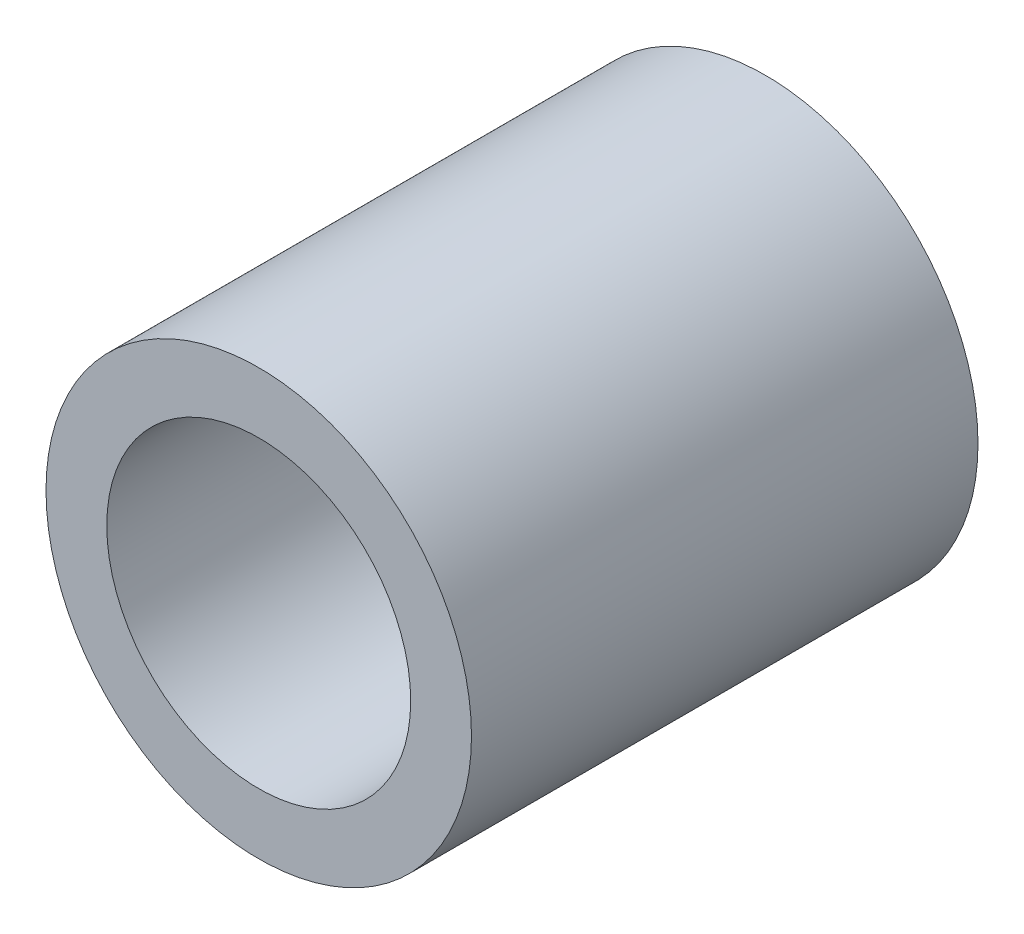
ISO-10303-21;
HEADER;
FILE_DESCRIPTION(('STEP AP214'),'2;1');
FILE_NAME('part.step','',(''),(''),'','','');
FILE_SCHEMA(('AUTOMOTIVE_DESIGN { 1 0 10303 214 1 1 1 1 }'));
ENDSEC;
DATA;
#1=APPLICATION_CONTEXT('core data for automotive mechanical design processes');
#2=APPLICATION_PROTOCOL_DEFINITION('international standard','automotive_design',2000,#1);
#3=PRODUCT_CONTEXT('',#1,'mechanical');
#4=PRODUCT('Part','Part','',(#3));
#5=PRODUCT_RELATED_PRODUCT_CATEGORY('part','',(#4));
#6=PRODUCT_DEFINITION_FORMATION('','',#4);
#7=PRODUCT_DEFINITION_CONTEXT('part definition',#1,'design');
#8=PRODUCT_DEFINITION('design','',#6,#7);
#9=PRODUCT_DEFINITION_SHAPE('','',#8);
#10=(LENGTH_UNIT() NAMED_UNIT(*) SI_UNIT(.MILLI.,.METRE.));
#11=(NAMED_UNIT(*) PLANE_ANGLE_UNIT() SI_UNIT($,.RADIAN.));
#12=(NAMED_UNIT(*) SI_UNIT($,.STERADIAN.) SOLID_ANGLE_UNIT());
#13=UNCERTAINTY_MEASURE_WITH_UNIT(LENGTH_MEASURE(1.E-05),#10,'distance_accuracy_value','');
#14=(GEOMETRIC_REPRESENTATION_CONTEXT(3) GLOBAL_UNCERTAINTY_ASSIGNED_CONTEXT((#13)) GLOBAL_UNIT_ASSIGNED_CONTEXT((#10,
#11,#12)) REPRESENTATION_CONTEXT('',''));
#15=CARTESIAN_POINT('',(0.,0.,0.));
#16=DIRECTION('',(0.,0.,1.));
#17=DIRECTION('',(1.,0.,0.));
#18=AXIS2_PLACEMENT_3D('',#15,#16,#17);
#19=CARTESIAN_POINT('',(0.,0.,25.4));
#20=DIRECTION('',(0.,0.,1.));
#21=DIRECTION('',(1.,0.,0.));
#22=AXIS2_PLACEMENT_3D('',#19,#20,#21);
#23=PLANE('',#22);
#24=CARTESIAN_POINT('',(0.,0.,25.4));
#25=DIRECTION('',(0.,0.,1.));
#26=DIRECTION('',(1.,0.,0.));
#27=AXIS2_PLACEMENT_3D('',#24,#25,#26);
#28=CIRCLE('',#27,10.668);
#29=CARTESIAN_POINT('',(10.668,0.,25.4));
#30=VERTEX_POINT('',#29);
#31=EDGE_CURVE('E10',#30,#30,#28,.T.);
#32=ORIENTED_EDGE('',*,*,#31,.T.);
#33=EDGE_LOOP('',(#32));
#34=FACE_BOUND('',#33,.T.);
#35=CARTESIAN_POINT('',(0.,0.,25.4));
#36=DIRECTION('',(0.,0.,1.));
#37=DIRECTION('',(1.,0.,0.));
#38=AXIS2_PLACEMENT_3D('',#35,#36,#37);
#39=CIRCLE('',#38,7.62);
#40=CARTESIAN_POINT('',(7.62,0.,25.4));
#41=VERTEX_POINT('',#40);
#42=EDGE_CURVE('E39',#41,#41,#39,.T.);
#43=ORIENTED_EDGE('',*,*,#42,.F.);
#44=EDGE_LOOP('',(#43));
#45=FACE_BOUND('',#44,.T.);
#46=ADVANCED_FACE('F28',(#34,#45),#23,.T.);
#47=CARTESIAN_POINT('',(0.,0.,0.));
#48=DIRECTION('',(0.,0.,1.));
#49=DIRECTION('',(1.,0.,0.));
#50=AXIS2_PLACEMENT_3D('',#47,#48,#49);
#51=PLANE('',#50);
#52=CARTESIAN_POINT('',(0.,0.,0.));
#53=DIRECTION('',(0.,0.,1.));
#54=DIRECTION('',(1.,0.,0.));
#55=AXIS2_PLACEMENT_3D('',#52,#53,#54);
#56=CIRCLE('',#55,10.668);
#57=CARTESIAN_POINT('',(10.668,0.,0.));
#58=VERTEX_POINT('',#57);
#59=EDGE_CURVE('E32',#58,#58,#56,.T.);
#60=ORIENTED_EDGE('',*,*,#59,.F.);
#61=EDGE_LOOP('',(#60));
#62=FACE_BOUND('',#61,.T.);
#63=CARTESIAN_POINT('',(0.,0.,0.));
#64=DIRECTION('',(0.,0.,1.));
#65=DIRECTION('',(1.,0.,0.));
#66=AXIS2_PLACEMENT_3D('',#63,#64,#65);
#67=CIRCLE('',#66,7.62);
#68=CARTESIAN_POINT('',(7.62,0.,0.));
#69=VERTEX_POINT('',#68);
#70=EDGE_CURVE('E41',#69,#69,#67,.T.);
#71=ORIENTED_EDGE('',*,*,#70,.T.);
#72=EDGE_LOOP('',(#71));
#73=FACE_BOUND('',#72,.T.);
#74=ADVANCED_FACE('F51',(#62,#73),#51,.F.);
#75=CARTESIAN_POINT('',(0.,0.,25.4));
#76=DIRECTION('',(0.,0.,-1.));
#77=DIRECTION('',(-1.,0.,0.));
#78=AXIS2_PLACEMENT_3D('',#75,#76,#77);
#79=CYLINDRICAL_SURFACE('',#78,10.668);
#80=ORIENTED_EDGE('',*,*,#31,.F.);
#81=EDGE_LOOP('',(#80));
#82=FACE_BOUND('',#81,.T.);
#83=ORIENTED_EDGE('',*,*,#59,.T.);
#84=EDGE_LOOP('',(#83));
#85=FACE_BOUND('',#84,.T.);
#86=ADVANCED_FACE('F30',(#82,#85),#79,.T.);
#87=CARTESIAN_POINT('',(0.,0.,25.4));
#88=DIRECTION('',(0.,0.,-1.));
#89=DIRECTION('',(-1.,0.,0.));
#90=AXIS2_PLACEMENT_3D('',#87,#88,#89);
#91=CYLINDRICAL_SURFACE('',#90,7.62);
#92=ORIENTED_EDGE('',*,*,#42,.T.);
#93=EDGE_LOOP('',(#92));
#94=FACE_BOUND('',#93,.T.);
#95=ORIENTED_EDGE('',*,*,#70,.F.);
#96=EDGE_LOOP('',(#95));
#97=FACE_BOUND('',#96,.T.);
#98=ADVANCED_FACE('F47',(#94,#97),#91,.F.);
#99=CLOSED_SHELL('',(#46,#74,#86,#98));
#100=MANIFOLD_SOLID_BREP('B2',#99);
#101=ADVANCED_BREP_SHAPE_REPRESENTATION('',(#18,#100),#14);
#102=SHAPE_DEFINITION_REPRESENTATION(#9,#101);
ENDSEC;
END-ISO-10303-21;
